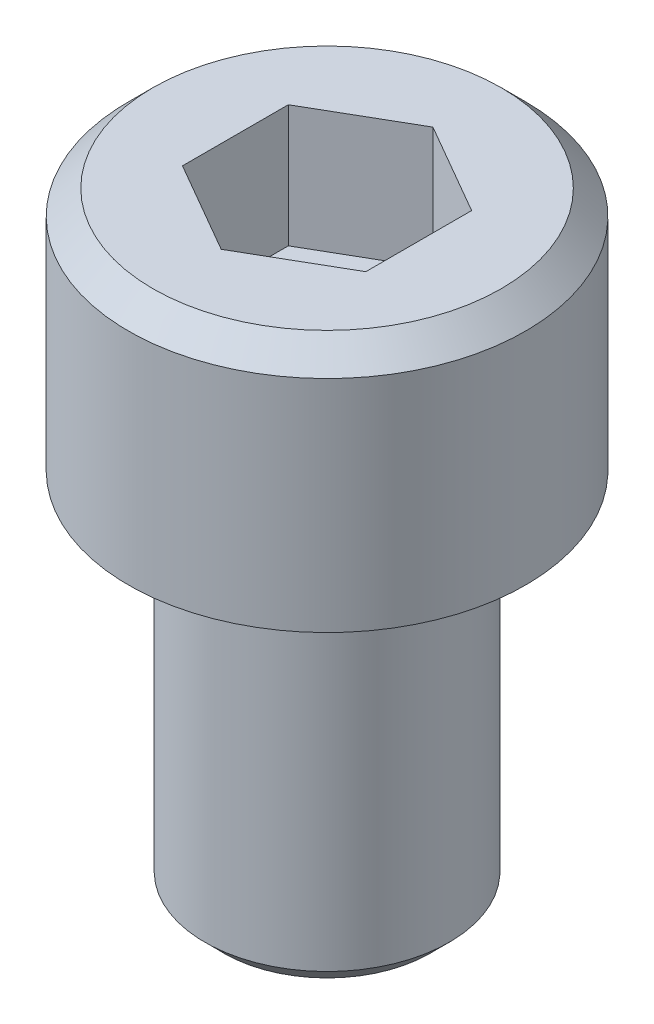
ISO-10303-21;
HEADER;
FILE_DESCRIPTION(('STEP AP214'),'2;1');
FILE_NAME('part.step','',(''),(''),'','','');
FILE_SCHEMA(('AUTOMOTIVE_DESIGN { 1 0 10303 214 1 1 1 1 }'));
ENDSEC;
DATA;
#1=APPLICATION_CONTEXT('core data for automotive mechanical design processes');
#2=APPLICATION_PROTOCOL_DEFINITION('international standard','automotive_design',2000,#1);
#3=PRODUCT_CONTEXT('',#1,'mechanical');
#4=PRODUCT('Part','Part','',(#3));
#5=PRODUCT_RELATED_PRODUCT_CATEGORY('part','',(#4));
#6=PRODUCT_DEFINITION_FORMATION('','',#4);
#7=PRODUCT_DEFINITION_CONTEXT('part definition',#1,'design');
#8=PRODUCT_DEFINITION('design','',#6,#7);
#9=PRODUCT_DEFINITION_SHAPE('','',#8);
#10=(LENGTH_UNIT() NAMED_UNIT(*) SI_UNIT(.MILLI.,.METRE.));
#11=(NAMED_UNIT(*) PLANE_ANGLE_UNIT() SI_UNIT($,.RADIAN.));
#12=(NAMED_UNIT(*) SI_UNIT($,.STERADIAN.) SOLID_ANGLE_UNIT());
#13=UNCERTAINTY_MEASURE_WITH_UNIT(LENGTH_MEASURE(1.E-05),#10,'distance_accuracy_value','');
#14=(GEOMETRIC_REPRESENTATION_CONTEXT(3) GLOBAL_UNCERTAINTY_ASSIGNED_CONTEXT((#13)) GLOBAL_UNIT_ASSIGNED_CONTEXT((#10,
#11,#12)) REPRESENTATION_CONTEXT('',''));
#15=CARTESIAN_POINT('',(0.,0.,0.));
#16=DIRECTION('',(0.,0.,1.));
#17=DIRECTION('',(1.,0.,0.));
#18=AXIS2_PLACEMENT_3D('',#15,#16,#17);
#19=CARTESIAN_POINT('',(0.,20.,0.));
#20=DIRECTION('',(0.,1.,0.));
#21=DIRECTION('',(0.,0.,1.));
#22=AXIS2_PLACEMENT_3D('',#19,#20,#21);
#23=PLANE('',#22);
#24=DIRECTION('',(0.,0.,-1.));
#25=VECTOR('',#24,1.);
#26=CARTESIAN_POINT('',(3.,20.,1.73205080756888));
#27=LINE('',#26,#25);
#28=CARTESIAN_POINT('',(3.,20.,1.73205080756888));
#29=VERTEX_POINT('',#28);
#30=CARTESIAN_POINT('',(3.,20.,-1.73205080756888));
#31=VERTEX_POINT('',#30);
#32=EDGE_CURVE('E49',#29,#31,#27,.T.);
#33=ORIENTED_EDGE('',*,*,#32,.F.);
#34=DIRECTION('',(0.866025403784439,0.,-0.499999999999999));
#35=VECTOR('',#34,1.);
#36=CARTESIAN_POINT('',(0.,20.,3.46410161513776));
#37=LINE('',#36,#35);
#38=CARTESIAN_POINT('',(0.,20.,3.46410161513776));
#39=VERTEX_POINT('',#38);
#40=EDGE_CURVE('E132',#39,#29,#37,.T.);
#41=ORIENTED_EDGE('',*,*,#40,.F.);
#42=DIRECTION('',(0.866025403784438,0.,0.5));
#43=VECTOR('',#42,1.);
#44=CARTESIAN_POINT('',(-3.,20.,1.73205080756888));
#45=LINE('',#44,#43);
#46=CARTESIAN_POINT('',(-3.,20.,1.73205080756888));
#47=VERTEX_POINT('',#46);
#48=EDGE_CURVE('E130',#47,#39,#45,.T.);
#49=ORIENTED_EDGE('',*,*,#48,.F.);
#50=DIRECTION('',(0.,0.,1.));
#51=VECTOR('',#50,1.);
#52=CARTESIAN_POINT('',(-3.,20.,-1.73205080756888));
#53=LINE('',#52,#51);
#54=CARTESIAN_POINT('',(-3.,20.,-1.73205080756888));
#55=VERTEX_POINT('',#54);
#56=EDGE_CURVE('E97',#55,#47,#53,.T.);
#57=ORIENTED_EDGE('',*,*,#56,.F.);
#58=DIRECTION('',(-0.866025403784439,0.,0.499999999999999));
#59=VECTOR('',#58,1.);
#60=CARTESIAN_POINT('',(0.,20.,-3.46410161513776));
#61=LINE('',#60,#59);
#62=CARTESIAN_POINT('',(0.,20.,-3.46410161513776));
#63=VERTEX_POINT('',#62);
#64=EDGE_CURVE('E126',#63,#55,#61,.T.);
#65=ORIENTED_EDGE('',*,*,#64,.F.);
#66=DIRECTION('',(-0.866025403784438,0.,-0.5));
#67=VECTOR('',#66,1.);
#68=CARTESIAN_POINT('',(3.,20.,-1.73205080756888));
#69=LINE('',#68,#67);
#70=EDGE_CURVE('E123',#31,#63,#69,.T.);
#71=ORIENTED_EDGE('',*,*,#70,.F.);
#72=EDGE_LOOP('',(#33,#41,#49,#57,#65,#71));
#73=FACE_BOUND('',#72,.T.);
#74=CARTESIAN_POINT('',(0.,20.,0.));
#75=DIRECTION('',(0.,-1.,0.));
#76=DIRECTION('',(0.,0.,-1.));
#77=AXIS2_PLACEMENT_3D('',#74,#75,#76);
#78=CIRCLE('',#77,5.69999999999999);
#79=CARTESIAN_POINT('',(0.,20.,-5.69999999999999));
#80=VERTEX_POINT('',#79);
#81=EDGE_CURVE('E150',#80,#80,#78,.T.);
#82=ORIENTED_EDGE('',*,*,#81,.F.);
#83=EDGE_LOOP('',(#82));
#84=FACE_BOUND('',#83,.T.);
#85=ADVANCED_FACE('F34',(#73,#84),#23,.T.);
#86=CARTESIAN_POINT('',(0.,19.2,0.));
#87=DIRECTION('',(0.,-1.,0.));
#88=DIRECTION('',(0.,0.,-1.));
#89=AXIS2_PLACEMENT_3D('',#86,#87,#88);
#90=CONICAL_SURFACE('',#89,6.49999999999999,0.785398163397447);
#91=ORIENTED_EDGE('',*,*,#81,.T.);
#92=EDGE_LOOP('',(#91));
#93=FACE_BOUND('',#92,.T.);
#94=CARTESIAN_POINT('',(0.,19.2,0.));
#95=DIRECTION('',(0.,-1.,0.));
#96=DIRECTION('',(0.,0.,-1.));
#97=AXIS2_PLACEMENT_3D('',#94,#95,#96);
#98=CIRCLE('',#97,6.49999999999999);
#99=CARTESIAN_POINT('',(0.,19.2,-6.49999999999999));
#100=VERTEX_POINT('',#99);
#101=EDGE_CURVE('E147',#100,#100,#98,.T.);
#102=ORIENTED_EDGE('',*,*,#101,.F.);
#103=EDGE_LOOP('',(#102));
#104=FACE_BOUND('',#103,.T.);
#105=ADVANCED_FACE('F166',(#93,#104),#90,.T.);
#106=CARTESIAN_POINT('',(0.,0.,0.));
#107=DIRECTION('',(0.,-1.,0.));
#108=DIRECTION('',(0.,0.,-1.));
#109=AXIS2_PLACEMENT_3D('',#106,#107,#108);
#110=CYLINDRICAL_SURFACE('',#109,6.49999999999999);
#111=ORIENTED_EDGE('',*,*,#101,.T.);
#112=EDGE_LOOP('',(#111));
#113=FACE_BOUND('',#112,.T.);
#114=CARTESIAN_POINT('',(0.,12.,0.));
#115=DIRECTION('',(0.,-1.,0.));
#116=DIRECTION('',(0.,0.,-1.));
#117=AXIS2_PLACEMENT_3D('',#114,#115,#116);
#118=CIRCLE('',#117,6.49999999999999);
#119=CARTESIAN_POINT('',(0.,12.,-6.49999999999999));
#120=VERTEX_POINT('',#119);
#121=EDGE_CURVE('E144',#120,#120,#118,.T.);
#122=ORIENTED_EDGE('',*,*,#121,.F.);
#123=EDGE_LOOP('',(#122));
#124=FACE_BOUND('',#123,.T.);
#125=ADVANCED_FACE('F171',(#113,#124),#110,.T.);
#126=CARTESIAN_POINT('',(6.49999999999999,12.,0.));
#127=DIRECTION('',(0.,-1.,0.));
#128=DIRECTION('',(0.,0.,-1.));
#129=AXIS2_PLACEMENT_3D('',#126,#127,#128);
#130=PLANE('',#129);
#131=ORIENTED_EDGE('',*,*,#121,.T.);
#132=EDGE_LOOP('',(#131));
#133=FACE_BOUND('',#132,.T.);
#134=CARTESIAN_POINT('',(0.,12.,0.));
#135=DIRECTION('',(0.,-1.,0.));
#136=DIRECTION('',(0.,0.,-1.));
#137=AXIS2_PLACEMENT_3D('',#134,#135,#136);
#138=CIRCLE('',#137,4.);
#139=CARTESIAN_POINT('',(0.,12.,-4.));
#140=VERTEX_POINT('',#139);
#141=EDGE_CURVE('E136',#140,#140,#138,.T.);
#142=ORIENTED_EDGE('',*,*,#141,.F.);
#143=EDGE_LOOP('',(#142));
#144=FACE_BOUND('',#143,.T.);
#145=ADVANCED_FACE('F178',(#133,#144),#130,.T.);
#146=CARTESIAN_POINT('',(0.,0.,0.));
#147=DIRECTION('',(0.,-1.,0.));
#148=DIRECTION('',(0.,0.,-1.));
#149=AXIS2_PLACEMENT_3D('',#146,#147,#148);
#150=CYLINDRICAL_SURFACE('',#149,4.);
#151=CARTESIAN_POINT('',(0.,0.625000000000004,0.));
#152=DIRECTION('',(0.,-1.,0.));
#153=DIRECTION('',(0.,0.,-1.));
#154=AXIS2_PLACEMENT_3D('',#151,#152,#153);
#155=CIRCLE('',#154,4.);
#156=CARTESIAN_POINT('',(0.,0.625000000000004,-4.));
#157=VERTEX_POINT('',#156);
#158=EDGE_CURVE('E11',#157,#157,#155,.F.);
#159=ORIENTED_EDGE('',*,*,#158,.T.);
#160=EDGE_LOOP('',(#159));
#161=FACE_BOUND('',#160,.T.);
#162=ORIENTED_EDGE('',*,*,#141,.T.);
#163=EDGE_LOOP('',(#162));
#164=FACE_BOUND('',#163,.T.);
#165=ADVANCED_FACE('F182',(#161,#164),#150,.T.);
#166=CARTESIAN_POINT('',(4.,0.,0.));
#167=DIRECTION('',(0.,-1.,0.));
#168=DIRECTION('',(0.,0.,-1.));
#169=AXIS2_PLACEMENT_3D('',#166,#167,#168);
#170=PLANE('',#169);
#171=CARTESIAN_POINT('',(0.,0.,0.));
#172=DIRECTION('',(0.,-1.,0.));
#173=DIRECTION('',(0.,0.,-1.));
#174=AXIS2_PLACEMENT_3D('',#171,#172,#173);
#175=CIRCLE('',#174,3.375);
#176=CARTESIAN_POINT('',(0.,0.,-3.375));
#177=VERTEX_POINT('',#176);
#178=EDGE_CURVE('E42',#177,#177,#175,.T.);
#179=ORIENTED_EDGE('',*,*,#178,.T.);
#180=EDGE_LOOP('',(#179));
#181=FACE_BOUND('',#180,.T.);
#182=ADVANCED_FACE('F155',(#181),#170,.T.);
#183=CARTESIAN_POINT('',(3.,16.,1.73205080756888));
#184=DIRECTION('',(1.,0.,0.));
#185=DIRECTION('',(0.,0.,-1.));
#186=AXIS2_PLACEMENT_3D('',#183,#184,#185);
#187=PLANE('',#186);
#188=ORIENTED_EDGE('',*,*,#32,.T.);
#189=DIRECTION('',(0.,1.,0.));
#190=VECTOR('',#189,1.);
#191=CARTESIAN_POINT('',(3.,16.,-1.73205080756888));
#192=LINE('',#191,#190);
#193=CARTESIAN_POINT('',(3.,16.,-1.73205080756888));
#194=VERTEX_POINT('',#193);
#195=EDGE_CURVE('E79',#194,#31,#192,.T.);
#196=ORIENTED_EDGE('',*,*,#195,.F.);
#197=DIRECTION('',(0.,0.,-1.));
#198=VECTOR('',#197,1.);
#199=CARTESIAN_POINT('',(3.,16.,1.73205080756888));
#200=LINE('',#199,#198);
#201=CARTESIAN_POINT('',(3.,16.,1.73205080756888));
#202=VERTEX_POINT('',#201);
#203=EDGE_CURVE('E134',#202,#194,#200,.T.);
#204=ORIENTED_EDGE('',*,*,#203,.F.);
#205=DIRECTION('',(0.,1.,0.));
#206=VECTOR('',#205,1.);
#207=CARTESIAN_POINT('',(3.,16.,1.73205080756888));
#208=LINE('',#207,#206);
#209=EDGE_CURVE('E57',#202,#29,#208,.T.);
#210=ORIENTED_EDGE('',*,*,#209,.T.);
#211=EDGE_LOOP('',(#188,#196,#204,#210));
#212=FACE_BOUND('',#211,.T.);
#213=ADVANCED_FACE('F189',(#212),#187,.F.);
#214=CARTESIAN_POINT('',(0.,16.,3.46410161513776));
#215=DIRECTION('',(0.499999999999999,0.,0.866025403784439));
#216=DIRECTION('',(0.866025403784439,0.,-0.499999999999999));
#217=AXIS2_PLACEMENT_3D('',#214,#215,#216);
#218=PLANE('',#217);
#219=ORIENTED_EDGE('',*,*,#40,.T.);
#220=ORIENTED_EDGE('',*,*,#209,.F.);
#221=DIRECTION('',(0.866025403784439,0.,-0.499999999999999));
#222=VECTOR('',#221,1.);
#223=CARTESIAN_POINT('',(0.,16.,3.46410161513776));
#224=LINE('',#223,#222);
#225=CARTESIAN_POINT('',(0.,16.,3.46410161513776));
#226=VERTEX_POINT('',#225);
#227=EDGE_CURVE('E109',#226,#202,#224,.T.);
#228=ORIENTED_EDGE('',*,*,#227,.F.);
#229=DIRECTION('',(0.,1.,0.));
#230=VECTOR('',#229,1.);
#231=CARTESIAN_POINT('',(0.,16.,3.46410161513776));
#232=LINE('',#231,#230);
#233=EDGE_CURVE('E101',#226,#39,#232,.T.);
#234=ORIENTED_EDGE('',*,*,#233,.T.);
#235=EDGE_LOOP('',(#219,#220,#228,#234));
#236=FACE_BOUND('',#235,.T.);
#237=ADVANCED_FACE('F192',(#236),#218,.F.);
#238=CARTESIAN_POINT('',(-3.,16.,1.73205080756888));
#239=DIRECTION('',(-0.5,0.,0.866025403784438));
#240=DIRECTION('',(0.866025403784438,0.,0.5));
#241=AXIS2_PLACEMENT_3D('',#238,#239,#240);
#242=PLANE('',#241);
#243=ORIENTED_EDGE('',*,*,#48,.T.);
#244=ORIENTED_EDGE('',*,*,#233,.F.);
#245=DIRECTION('',(0.866025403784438,0.,0.5));
#246=VECTOR('',#245,1.);
#247=CARTESIAN_POINT('',(-3.,16.,1.73205080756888));
#248=LINE('',#247,#246);
#249=CARTESIAN_POINT('',(-3.,16.,1.73205080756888));
#250=VERTEX_POINT('',#249);
#251=EDGE_CURVE('E105',#250,#226,#248,.T.);
#252=ORIENTED_EDGE('',*,*,#251,.F.);
#253=DIRECTION('',(0.,1.,0.));
#254=VECTOR('',#253,1.);
#255=CARTESIAN_POINT('',(-3.,16.,1.73205080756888));
#256=LINE('',#255,#254);
#257=EDGE_CURVE('E90',#250,#47,#256,.T.);
#258=ORIENTED_EDGE('',*,*,#257,.T.);
#259=EDGE_LOOP('',(#243,#244,#252,#258));
#260=FACE_BOUND('',#259,.T.);
#261=ADVANCED_FACE('F106',(#260),#242,.F.);
#262=CARTESIAN_POINT('',(-3.,16.,-1.73205080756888));
#263=DIRECTION('',(-1.,0.,0.));
#264=DIRECTION('',(0.,0.,1.));
#265=AXIS2_PLACEMENT_3D('',#262,#263,#264);
#266=PLANE('',#265);
#267=ORIENTED_EDGE('',*,*,#56,.T.);
#268=ORIENTED_EDGE('',*,*,#257,.F.);
#269=DIRECTION('',(0.,0.,1.));
#270=VECTOR('',#269,1.);
#271=CARTESIAN_POINT('',(-3.,16.,-1.73205080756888));
#272=LINE('',#271,#270);
#273=CARTESIAN_POINT('',(-3.,16.,-1.73205080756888));
#274=VERTEX_POINT('',#273);
#275=EDGE_CURVE('E94',#274,#250,#272,.T.);
#276=ORIENTED_EDGE('',*,*,#275,.F.);
#277=DIRECTION('',(0.,1.,0.));
#278=VECTOR('',#277,1.);
#279=CARTESIAN_POINT('',(-3.,16.,-1.73205080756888));
#280=LINE('',#279,#278);
#281=EDGE_CURVE('E102',#274,#55,#280,.T.);
#282=ORIENTED_EDGE('',*,*,#281,.T.);
#283=EDGE_LOOP('',(#267,#268,#276,#282));
#284=FACE_BOUND('',#283,.T.);
#285=ADVANCED_FACE('F92',(#284),#266,.F.);
#286=CARTESIAN_POINT('',(0.,16.,-3.46410161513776));
#287=DIRECTION('',(-0.499999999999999,0.,-0.866025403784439));
#288=DIRECTION('',(-0.866025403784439,0.,0.499999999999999));
#289=AXIS2_PLACEMENT_3D('',#286,#287,#288);
#290=PLANE('',#289);
#291=ORIENTED_EDGE('',*,*,#64,.T.);
#292=ORIENTED_EDGE('',*,*,#281,.F.);
#293=DIRECTION('',(-0.866025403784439,0.,0.499999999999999));
#294=VECTOR('',#293,1.);
#295=CARTESIAN_POINT('',(0.,16.,-3.46410161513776));
#296=LINE('',#295,#294);
#297=CARTESIAN_POINT('',(0.,16.,-3.46410161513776));
#298=VERTEX_POINT('',#297);
#299=EDGE_CURVE('E115',#298,#274,#296,.T.);
#300=ORIENTED_EDGE('',*,*,#299,.F.);
#301=DIRECTION('',(0.,1.,0.));
#302=VECTOR('',#301,1.);
#303=CARTESIAN_POINT('',(0.,16.,-3.46410161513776));
#304=LINE('',#303,#302);
#305=EDGE_CURVE('E139',#298,#63,#304,.T.);
#306=ORIENTED_EDGE('',*,*,#305,.T.);
#307=EDGE_LOOP('',(#291,#292,#300,#306));
#308=FACE_BOUND('',#307,.T.);
#309=ADVANCED_FACE('F195',(#308),#290,.F.);
#310=CARTESIAN_POINT('',(3.,16.,-1.73205080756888));
#311=DIRECTION('',(0.500000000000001,0.,-0.866025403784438));
#312=DIRECTION('',(-0.866025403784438,0.,-0.500000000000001));
#313=AXIS2_PLACEMENT_3D('',#310,#311,#312);
#314=PLANE('',#313);
#315=ORIENTED_EDGE('',*,*,#70,.T.);
#316=ORIENTED_EDGE('',*,*,#305,.F.);
#317=DIRECTION('',(-0.866025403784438,0.,-0.5));
#318=VECTOR('',#317,1.);
#319=CARTESIAN_POINT('',(3.,16.,-1.73205080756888));
#320=LINE('',#319,#318);
#321=EDGE_CURVE('E117',#194,#298,#320,.T.);
#322=ORIENTED_EDGE('',*,*,#321,.F.);
#323=ORIENTED_EDGE('',*,*,#195,.T.);
#324=EDGE_LOOP('',(#315,#316,#322,#323));
#325=FACE_BOUND('',#324,.T.);
#326=ADVANCED_FACE('F162',(#325),#314,.F.);
#327=CARTESIAN_POINT('',(0.,16.,0.));
#328=DIRECTION('',(0.,1.,0.));
#329=DIRECTION('',(0.,0.,1.));
#330=AXIS2_PLACEMENT_3D('',#327,#328,#329);
#331=PLANE('',#330);
#332=ORIENTED_EDGE('',*,*,#203,.T.);
#333=ORIENTED_EDGE('',*,*,#321,.T.);
#334=ORIENTED_EDGE('',*,*,#299,.T.);
#335=ORIENTED_EDGE('',*,*,#275,.T.);
#336=ORIENTED_EDGE('',*,*,#251,.T.);
#337=ORIENTED_EDGE('',*,*,#227,.T.);
#338=EDGE_LOOP('',(#332,#333,#334,#335,#336,#337));
#339=FACE_BOUND('',#338,.T.);
#340=ADVANCED_FACE('F112',(#339),#331,.T.);
#341=CARTESIAN_POINT('',(0.,0.,0.));
#342=DIRECTION('',(0.,1.,0.));
#343=DIRECTION('',(0.,0.,1.));
#344=AXIS2_PLACEMENT_3D('',#341,#342,#343);
#345=CONICAL_SURFACE('',#344,3.375,0.785398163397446);
#346=ORIENTED_EDGE('',*,*,#158,.F.);
#347=EDGE_LOOP('',(#346));
#348=FACE_BOUND('',#347,.T.);
#349=ORIENTED_EDGE('',*,*,#178,.F.);
#350=EDGE_LOOP('',(#349));
#351=FACE_BOUND('',#350,.T.);
#352=ADVANCED_FACE('F36',(#348,#351),#345,.T.);
#353=CLOSED_SHELL('',(#85,#105,#125,#145,#165,#182,#213,#237,#261,#285,#309,#326,#340,#352));
#354=MANIFOLD_SOLID_BREP('B2',#353);
#355=ADVANCED_BREP_SHAPE_REPRESENTATION('',(#18,#354),#14);
#356=SHAPE_DEFINITION_REPRESENTATION(#9,#355);
ENDSEC;
END-ISO-10303-21;
